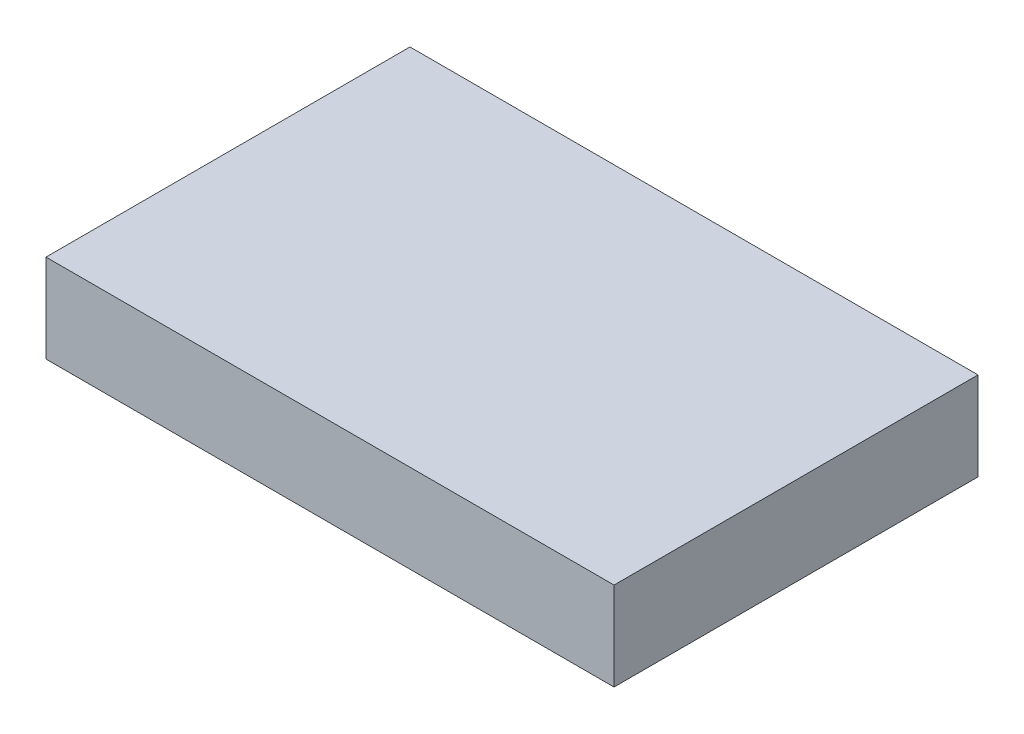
from build123d import *

# Parameters (mm, degrees)
SKETCH1_W      = 173.591221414
SKETCH1_H      = 111.229315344
EXTRUDE1_DEPTH = 27


with BuildPart() as part:
    # Sketch1 → Extrude1 (new body)
    with BuildSketch(Plane(origin=(0, 0, 0), x_dir=(1, 0, 0), z_dir=(0, 1, 0))):
        Rectangle(SKETCH1_W, SKETCH1_H)
    extrude(amount=EXTRUDE1_DEPTH)


solid = part.part
